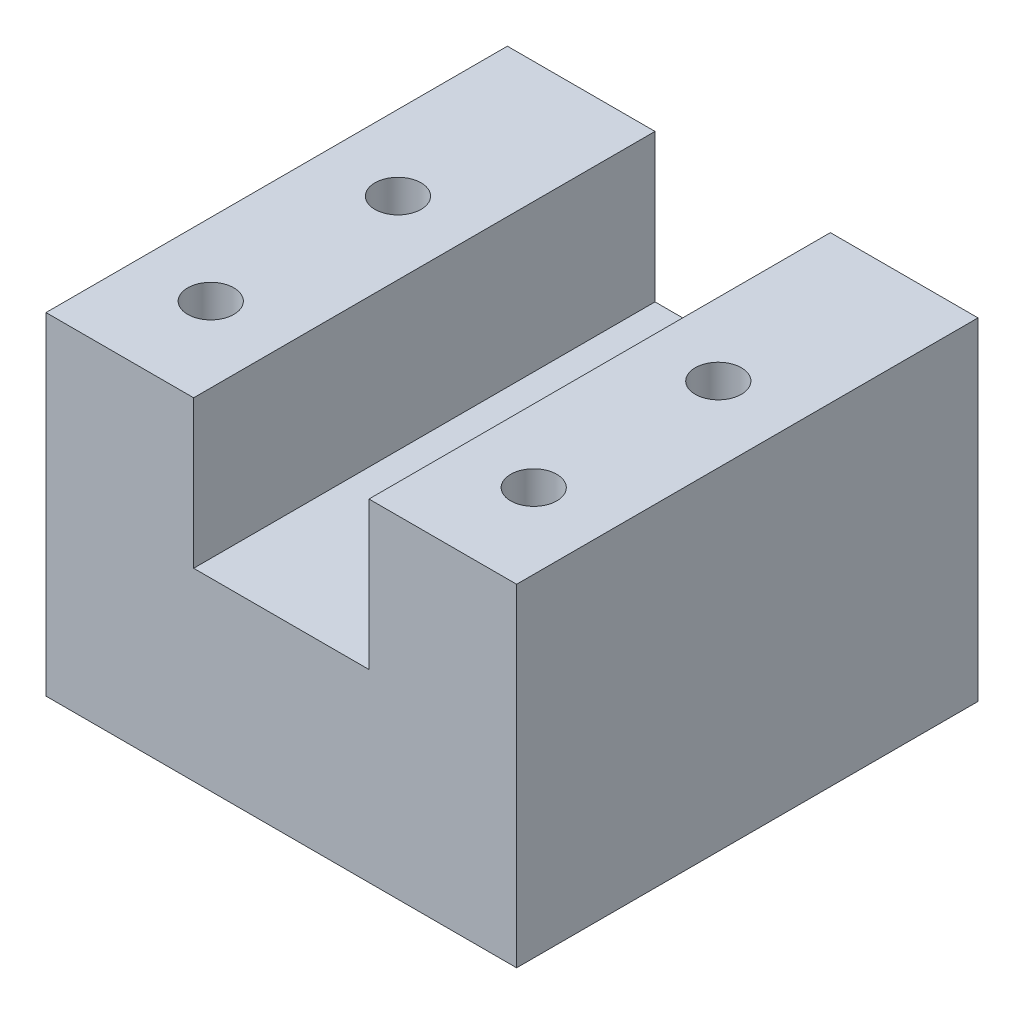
ISO-10303-21;
HEADER;
FILE_DESCRIPTION(('STEP AP214'),'2;1');
FILE_NAME('part.step','',(''),(''),'','','');
FILE_SCHEMA(('AUTOMOTIVE_DESIGN { 1 0 10303 214 1 1 1 1 }'));
ENDSEC;
DATA;
#1=APPLICATION_CONTEXT('core data for automotive mechanical design processes');
#2=APPLICATION_PROTOCOL_DEFINITION('international standard','automotive_design',2000,#1);
#3=PRODUCT_CONTEXT('',#1,'mechanical');
#4=PRODUCT('Part','Part','',(#3));
#5=PRODUCT_RELATED_PRODUCT_CATEGORY('part','',(#4));
#6=PRODUCT_DEFINITION_FORMATION('','',#4);
#7=PRODUCT_DEFINITION_CONTEXT('part definition',#1,'design');
#8=PRODUCT_DEFINITION('design','',#6,#7);
#9=PRODUCT_DEFINITION_SHAPE('','',#8);
#10=(LENGTH_UNIT() NAMED_UNIT(*) SI_UNIT(.MILLI.,.METRE.));
#11=(NAMED_UNIT(*) PLANE_ANGLE_UNIT() SI_UNIT($,.RADIAN.));
#12=(NAMED_UNIT(*) SI_UNIT($,.STERADIAN.) SOLID_ANGLE_UNIT());
#13=UNCERTAINTY_MEASURE_WITH_UNIT(LENGTH_MEASURE(1.E-05),#10,'distance_accuracy_value','');
#14=(GEOMETRIC_REPRESENTATION_CONTEXT(3) GLOBAL_UNCERTAINTY_ASSIGNED_CONTEXT((#13)) GLOBAL_UNIT_ASSIGNED_CONTEXT((#10,
#11,#12)) REPRESENTATION_CONTEXT('',''));
#15=CARTESIAN_POINT('',(0.,0.,0.));
#16=DIRECTION('',(0.,0.,1.));
#17=DIRECTION('',(1.,0.,0.));
#18=AXIS2_PLACEMENT_3D('',#15,#16,#17);
#19=CARTESIAN_POINT('',(8.,10.,25.));
#20=DIRECTION('',(0.,-1.,0.));
#21=DIRECTION('',(0.,0.,-1.));
#22=AXIS2_PLACEMENT_3D('',#19,#20,#21);
#23=PLANE('',#22);
#24=CARTESIAN_POINT('',(12.6780687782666,10.,6.5));
#25=DIRECTION('',(0.,1.,0.));
#26=DIRECTION('',(0.,0.,1.));
#27=AXIS2_PLACEMENT_3D('',#24,#25,#26);
#28=CIRCLE('',#27,2.);
#29=CARTESIAN_POINT('',(12.6780687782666,10.,8.5));
#30=VERTEX_POINT('',#29);
#31=EDGE_CURVE('E213',#30,#30,#28,.T.);
#32=ORIENTED_EDGE('',*,*,#31,.F.);
#33=EDGE_LOOP('',(#32));
#34=FACE_BOUND('',#33,.T.);
#35=DIRECTION('',(-1.,0.,0.));
#36=VECTOR('',#35,1.);
#37=CARTESIAN_POINT('',(8.,10.,0.));
#38=LINE('',#37,#36);
#39=CARTESIAN_POINT('',(17.5,10.,0.));
#40=VERTEX_POINT('',#39);
#41=CARTESIAN_POINT('',(8.,10.,0.));
#42=VERTEX_POINT('',#41);
#43=EDGE_CURVE('E129',#40,#42,#38,.T.);
#44=ORIENTED_EDGE('',*,*,#43,.T.);
#45=DIRECTION('',(0.,0.,-1.));
#46=VECTOR('',#45,1.);
#47=CARTESIAN_POINT('',(8.,10.,25.));
#48=LINE('',#47,#46);
#49=CARTESIAN_POINT('',(8.,10.,25.));
#50=VERTEX_POINT('',#49);
#51=EDGE_CURVE('E11',#50,#42,#48,.T.);
#52=ORIENTED_EDGE('',*,*,#51,.F.);
#53=DIRECTION('',(-1.,0.,0.));
#54=VECTOR('',#53,1.);
#55=CARTESIAN_POINT('',(8.,10.,25.));
#56=LINE('',#55,#54);
#57=CARTESIAN_POINT('',(17.5,10.,25.));
#58=VERTEX_POINT('',#57);
#59=EDGE_CURVE('E144',#58,#50,#56,.T.);
#60=ORIENTED_EDGE('',*,*,#59,.F.);
#61=DIRECTION('',(0.,0.,-1.));
#62=VECTOR('',#61,1.);
#63=CARTESIAN_POINT('',(17.5,10.,25.));
#64=LINE('',#63,#62);
#65=EDGE_CURVE('E125',#58,#40,#64,.T.);
#66=ORIENTED_EDGE('',*,*,#65,.T.);
#67=EDGE_LOOP('',(#44,#52,#60,#66));
#68=FACE_BOUND('',#67,.T.);
#69=ADVANCED_FACE('F32',(#34,#68),#23,.F.);
#70=CARTESIAN_POINT('',(8.,10.,25.));
#71=DIRECTION('',(-1.,0.,0.));
#72=DIRECTION('',(0.,0.,1.));
#73=AXIS2_PLACEMENT_3D('',#70,#71,#72);
#74=PLANE('',#73);
#75=DIRECTION('',(0.,1.,0.));
#76=VECTOR('',#75,1.);
#77=CARTESIAN_POINT('',(8.,10.,0.));
#78=LINE('',#77,#76);
#79=CARTESIAN_POINT('',(8.,18.,0.));
#80=VERTEX_POINT('',#79);
#81=EDGE_CURVE('E132',#42,#80,#78,.T.);
#82=ORIENTED_EDGE('',*,*,#81,.T.);
#83=DIRECTION('',(0.,0.,-1.));
#84=VECTOR('',#83,1.);
#85=CARTESIAN_POINT('',(8.,18.,25.));
#86=LINE('',#85,#84);
#87=CARTESIAN_POINT('',(8.,18.,25.));
#88=VERTEX_POINT('',#87);
#89=EDGE_CURVE('E41',#88,#80,#86,.T.);
#90=ORIENTED_EDGE('',*,*,#89,.F.);
#91=DIRECTION('',(0.,1.,0.));
#92=VECTOR('',#91,1.);
#93=CARTESIAN_POINT('',(8.,10.,25.));
#94=LINE('',#93,#92);
#95=EDGE_CURVE('E92',#50,#88,#94,.T.);
#96=ORIENTED_EDGE('',*,*,#95,.F.);
#97=ORIENTED_EDGE('',*,*,#51,.T.);
#98=EDGE_LOOP('',(#82,#90,#96,#97));
#99=FACE_BOUND('',#98,.T.);
#100=ADVANCED_FACE('F233',(#99),#74,.F.);
#101=CARTESIAN_POINT('',(0.,18.,25.));
#102=DIRECTION('',(0.,-1.,0.));
#103=DIRECTION('',(0.,0.,-1.));
#104=AXIS2_PLACEMENT_3D('',#101,#102,#103);
#105=PLANE('',#104);
#106=CARTESIAN_POINT('',(4.0719312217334,18.,10.));
#107=DIRECTION('',(0.,1.,0.));
#108=DIRECTION('',(0.,0.,-1.));
#109=AXIS2_PLACEMENT_3D('',#106,#107,#108);
#110=CIRCLE('',#109,1.25);
#111=CARTESIAN_POINT('',(4.0719312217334,18.,8.75));
#112=VERTEX_POINT('',#111);
#113=EDGE_CURVE('E196',#112,#112,#110,.T.);
#114=ORIENTED_EDGE('',*,*,#113,.F.);
#115=EDGE_LOOP('',(#114));
#116=FACE_BOUND('',#115,.T.);
#117=CARTESIAN_POINT('',(3.92806877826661,18.,20.));
#118=DIRECTION('',(0.,1.,0.));
#119=DIRECTION('',(0.,0.,1.));
#120=AXIS2_PLACEMENT_3D('',#117,#118,#119);
#121=CIRCLE('',#120,1.25);
#122=CARTESIAN_POINT('',(3.92806877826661,18.,21.25));
#123=VERTEX_POINT('',#122);
#124=EDGE_CURVE('E178',#123,#123,#121,.T.);
#125=ORIENTED_EDGE('',*,*,#124,.F.);
#126=EDGE_LOOP('',(#125));
#127=FACE_BOUND('',#126,.T.);
#128=DIRECTION('',(-1.,0.,0.));
#129=VECTOR('',#128,1.);
#130=CARTESIAN_POINT('',(0.,18.,0.));
#131=LINE('',#130,#129);
#132=CARTESIAN_POINT('',(0.,18.,0.));
#133=VERTEX_POINT('',#132);
#134=EDGE_CURVE('E135',#80,#133,#131,.T.);
#135=ORIENTED_EDGE('',*,*,#134,.T.);
#136=DIRECTION('',(0.,0.,-1.));
#137=VECTOR('',#136,1.);
#138=CARTESIAN_POINT('',(0.,18.,25.));
#139=LINE('',#138,#137);
#140=CARTESIAN_POINT('',(0.,18.,25.));
#141=VERTEX_POINT('',#140);
#142=EDGE_CURVE('E151',#141,#133,#139,.T.);
#143=ORIENTED_EDGE('',*,*,#142,.F.);
#144=DIRECTION('',(-1.,0.,0.));
#145=VECTOR('',#144,1.);
#146=CARTESIAN_POINT('',(0.,18.,25.));
#147=LINE('',#146,#145);
#148=EDGE_CURVE('E160',#88,#141,#147,.T.);
#149=ORIENTED_EDGE('',*,*,#148,.F.);
#150=ORIENTED_EDGE('',*,*,#89,.T.);
#151=EDGE_LOOP('',(#135,#143,#149,#150));
#152=FACE_BOUND('',#151,.T.);
#153=ADVANCED_FACE('F158',(#116,#127,#152),#105,.F.);
#154=CARTESIAN_POINT('',(0.,0.,25.));
#155=DIRECTION('',(1.,0.,0.));
#156=DIRECTION('',(0.,0.,-1.));
#157=AXIS2_PLACEMENT_3D('',#154,#155,#156);
#158=PLANE('',#157);
#159=DIRECTION('',(0.,-1.,0.));
#160=VECTOR('',#159,1.);
#161=CARTESIAN_POINT('',(0.,0.,0.));
#162=LINE('',#161,#160);
#163=CARTESIAN_POINT('',(0.,0.,0.));
#164=VERTEX_POINT('',#163);
#165=EDGE_CURVE('E137',#133,#164,#162,.T.);
#166=ORIENTED_EDGE('',*,*,#165,.T.);
#167=DIRECTION('',(0.,0.,-1.));
#168=VECTOR('',#167,1.);
#169=CARTESIAN_POINT('',(0.,0.,25.));
#170=LINE('',#169,#168);
#171=CARTESIAN_POINT('',(0.,0.,25.));
#172=VERTEX_POINT('',#171);
#173=EDGE_CURVE('E148',#172,#164,#170,.T.);
#174=ORIENTED_EDGE('',*,*,#173,.F.);
#175=DIRECTION('',(0.,-1.,0.));
#176=VECTOR('',#175,1.);
#177=CARTESIAN_POINT('',(0.,0.,25.));
#178=LINE('',#177,#176);
#179=EDGE_CURVE('E172',#141,#172,#178,.T.);
#180=ORIENTED_EDGE('',*,*,#179,.F.);
#181=ORIENTED_EDGE('',*,*,#142,.T.);
#182=EDGE_LOOP('',(#166,#174,#180,#181));
#183=FACE_BOUND('',#182,.T.);
#184=ADVANCED_FACE('F168',(#183),#158,.F.);
#185=CARTESIAN_POINT('',(0.,0.,25.));
#186=DIRECTION('',(0.,1.,0.));
#187=DIRECTION('',(0.,0.,1.));
#188=AXIS2_PLACEMENT_3D('',#185,#186,#187);
#189=PLANE('',#188);
#190=CARTESIAN_POINT('',(12.6780687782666,0.,6.5));
#191=DIRECTION('',(0.,1.,0.));
#192=DIRECTION('',(0.,0.,1.));
#193=AXIS2_PLACEMENT_3D('',#190,#191,#192);
#194=CIRCLE('',#193,2.);
#195=CARTESIAN_POINT('',(12.6780687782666,0.,8.5));
#196=VERTEX_POINT('',#195);
#197=EDGE_CURVE('E35',#196,#196,#194,.T.);
#198=ORIENTED_EDGE('',*,*,#197,.T.);
#199=EDGE_LOOP('',(#198));
#200=FACE_BOUND('',#199,.T.);
#201=CARTESIAN_POINT('',(21.4280687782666,0.,15.));
#202=DIRECTION('',(0.,-1.,0.));
#203=DIRECTION('',(0.,0.,-1.));
#204=AXIS2_PLACEMENT_3D('',#201,#202,#203);
#205=CIRCLE('',#204,1.66109742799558);
#206=CARTESIAN_POINT('',(21.4280687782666,0.,13.3389025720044));
#207=VERTEX_POINT('',#206);
#208=EDGE_CURVE('E208',#207,#207,#205,.T.);
#209=ORIENTED_EDGE('',*,*,#208,.F.);
#210=EDGE_LOOP('',(#209));
#211=FACE_BOUND('',#210,.T.);
#212=CARTESIAN_POINT('',(3.92806877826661,0.,15.));
#213=DIRECTION('',(0.,-1.,0.));
#214=DIRECTION('',(0.,0.,-1.));
#215=AXIS2_PLACEMENT_3D('',#212,#213,#214);
#216=CIRCLE('',#215,1.65);
#217=CARTESIAN_POINT('',(3.92806877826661,0.,13.35));
#218=VERTEX_POINT('',#217);
#219=EDGE_CURVE('E202',#218,#218,#216,.T.);
#220=ORIENTED_EDGE('',*,*,#219,.F.);
#221=EDGE_LOOP('',(#220));
#222=FACE_BOUND('',#221,.T.);
#223=DIRECTION('',(1.,0.,0.));
#224=VECTOR('',#223,1.);
#225=CARTESIAN_POINT('',(0.,0.,0.));
#226=LINE('',#225,#224);
#227=CARTESIAN_POINT('',(25.5,0.,0.));
#228=VERTEX_POINT('',#227);
#229=EDGE_CURVE('E139',#164,#228,#226,.T.);
#230=ORIENTED_EDGE('',*,*,#229,.T.);
#231=DIRECTION('',(0.,0.,-1.));
#232=VECTOR('',#231,1.);
#233=CARTESIAN_POINT('',(25.5,0.,25.));
#234=LINE('',#233,#232);
#235=CARTESIAN_POINT('',(25.5,0.,25.));
#236=VERTEX_POINT('',#235);
#237=EDGE_CURVE('E120',#236,#228,#234,.T.);
#238=ORIENTED_EDGE('',*,*,#237,.F.);
#239=DIRECTION('',(1.,0.,0.));
#240=VECTOR('',#239,1.);
#241=CARTESIAN_POINT('',(0.,0.,25.));
#242=LINE('',#241,#240);
#243=EDGE_CURVE('E111',#172,#236,#242,.T.);
#244=ORIENTED_EDGE('',*,*,#243,.F.);
#245=ORIENTED_EDGE('',*,*,#173,.T.);
#246=EDGE_LOOP('',(#230,#238,#244,#245));
#247=FACE_BOUND('',#246,.T.);
#248=ADVANCED_FACE('F171',(#200,#211,#222,#247),#189,.F.);
#249=CARTESIAN_POINT('',(25.5,0.,25.));
#250=DIRECTION('',(-1.,0.,0.));
#251=DIRECTION('',(0.,0.,1.));
#252=AXIS2_PLACEMENT_3D('',#249,#250,#251);
#253=PLANE('',#252);
#254=DIRECTION('',(0.,1.,0.));
#255=VECTOR('',#254,1.);
#256=CARTESIAN_POINT('',(25.5,0.,0.));
#257=LINE('',#256,#255);
#258=CARTESIAN_POINT('',(25.5,18.,0.));
#259=VERTEX_POINT('',#258);
#260=EDGE_CURVE('E119',#228,#259,#257,.T.);
#261=ORIENTED_EDGE('',*,*,#260,.T.);
#262=DIRECTION('',(0.,0.,-1.));
#263=VECTOR('',#262,1.);
#264=CARTESIAN_POINT('',(25.5,18.,25.));
#265=LINE('',#264,#263);
#266=CARTESIAN_POINT('',(25.5,18.,25.));
#267=VERTEX_POINT('',#266);
#268=EDGE_CURVE('E116',#267,#259,#265,.T.);
#269=ORIENTED_EDGE('',*,*,#268,.F.);
#270=DIRECTION('',(0.,1.,0.));
#271=VECTOR('',#270,1.);
#272=CARTESIAN_POINT('',(25.5,0.,25.));
#273=LINE('',#272,#271);
#274=EDGE_CURVE('E105',#236,#267,#273,.T.);
#275=ORIENTED_EDGE('',*,*,#274,.F.);
#276=ORIENTED_EDGE('',*,*,#237,.T.);
#277=EDGE_LOOP('',(#261,#269,#275,#276));
#278=FACE_BOUND('',#277,.T.);
#279=ADVANCED_FACE('F117',(#278),#253,.F.);
#280=CARTESIAN_POINT('',(17.5,18.,25.));
#281=DIRECTION('',(0.,-1.,0.));
#282=DIRECTION('',(0.,0.,-1.));
#283=AXIS2_PLACEMENT_3D('',#280,#281,#282);
#284=PLANE('',#283);
#285=CARTESIAN_POINT('',(21.4280687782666,18.,20.));
#286=DIRECTION('',(0.,1.,0.));
#287=DIRECTION('',(0.,0.,1.));
#288=AXIS2_PLACEMENT_3D('',#285,#286,#287);
#289=CIRCLE('',#288,1.25);
#290=CARTESIAN_POINT('',(21.4280687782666,18.,21.25));
#291=VERTEX_POINT('',#290);
#292=EDGE_CURVE('E190',#291,#291,#289,.T.);
#293=ORIENTED_EDGE('',*,*,#292,.F.);
#294=EDGE_LOOP('',(#293));
#295=FACE_BOUND('',#294,.T.);
#296=CARTESIAN_POINT('',(21.4280687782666,18.,10.));
#297=DIRECTION('',(0.,1.,0.));
#298=DIRECTION('',(0.,0.,1.));
#299=AXIS2_PLACEMENT_3D('',#296,#297,#298);
#300=CIRCLE('',#299,1.25);
#301=CARTESIAN_POINT('',(21.4280687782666,18.,11.25));
#302=VERTEX_POINT('',#301);
#303=EDGE_CURVE('E184',#302,#302,#300,.T.);
#304=ORIENTED_EDGE('',*,*,#303,.F.);
#305=EDGE_LOOP('',(#304));
#306=FACE_BOUND('',#305,.T.);
#307=DIRECTION('',(-1.,0.,0.));
#308=VECTOR('',#307,1.);
#309=CARTESIAN_POINT('',(17.5,18.,0.));
#310=LINE('',#309,#308);
#311=CARTESIAN_POINT('',(17.5,18.,0.));
#312=VERTEX_POINT('',#311);
#313=EDGE_CURVE('E78',#259,#312,#310,.T.);
#314=ORIENTED_EDGE('',*,*,#313,.T.);
#315=DIRECTION('',(0.,0.,-1.));
#316=VECTOR('',#315,1.);
#317=CARTESIAN_POINT('',(17.5,18.,25.));
#318=LINE('',#317,#316);
#319=CARTESIAN_POINT('',(17.5,18.,25.));
#320=VERTEX_POINT('',#319);
#321=EDGE_CURVE('E121',#320,#312,#318,.T.);
#322=ORIENTED_EDGE('',*,*,#321,.F.);
#323=DIRECTION('',(-1.,0.,0.));
#324=VECTOR('',#323,1.);
#325=CARTESIAN_POINT('',(17.5,18.,25.));
#326=LINE('',#325,#324);
#327=EDGE_CURVE('E109',#267,#320,#326,.T.);
#328=ORIENTED_EDGE('',*,*,#327,.F.);
#329=ORIENTED_EDGE('',*,*,#268,.T.);
#330=EDGE_LOOP('',(#314,#322,#328,#329));
#331=FACE_BOUND('',#330,.T.);
#332=ADVANCED_FACE('F123',(#295,#306,#331),#284,.F.);
#333=CARTESIAN_POINT('',(17.5,10.,25.));
#334=DIRECTION('',(1.,0.,0.));
#335=DIRECTION('',(0.,0.,-1.));
#336=AXIS2_PLACEMENT_3D('',#333,#334,#335);
#337=PLANE('',#336);
#338=DIRECTION('',(0.,-1.,0.));
#339=VECTOR('',#338,1.);
#340=CARTESIAN_POINT('',(17.5,10.,0.));
#341=LINE('',#340,#339);
#342=EDGE_CURVE('E84',#312,#40,#341,.T.);
#343=ORIENTED_EDGE('',*,*,#342,.T.);
#344=ORIENTED_EDGE('',*,*,#65,.F.);
#345=DIRECTION('',(0.,-1.,0.));
#346=VECTOR('',#345,1.);
#347=CARTESIAN_POINT('',(17.5,10.,25.));
#348=LINE('',#347,#346);
#349=EDGE_CURVE('E49',#320,#58,#348,.T.);
#350=ORIENTED_EDGE('',*,*,#349,.F.);
#351=ORIENTED_EDGE('',*,*,#321,.T.);
#352=EDGE_LOOP('',(#343,#344,#350,#351));
#353=FACE_BOUND('',#352,.T.);
#354=ADVANCED_FACE('F241',(#353),#337,.F.);
#355=CARTESIAN_POINT('',(17.5,10.,25.));
#356=DIRECTION('',(0.,0.,1.));
#357=DIRECTION('',(1.,0.,0.));
#358=AXIS2_PLACEMENT_3D('',#355,#356,#357);
#359=PLANE('',#358);
#360=ORIENTED_EDGE('',*,*,#59,.T.);
#361=ORIENTED_EDGE('',*,*,#95,.T.);
#362=ORIENTED_EDGE('',*,*,#148,.T.);
#363=ORIENTED_EDGE('',*,*,#179,.T.);
#364=ORIENTED_EDGE('',*,*,#243,.T.);
#365=ORIENTED_EDGE('',*,*,#274,.T.);
#366=ORIENTED_EDGE('',*,*,#327,.T.);
#367=ORIENTED_EDGE('',*,*,#349,.T.);
#368=EDGE_LOOP('',(#360,#361,#362,#363,#364,#365,#366,#367));
#369=FACE_BOUND('',#368,.T.);
#370=ADVANCED_FACE('F107',(#369),#359,.T.);
#371=CARTESIAN_POINT('',(17.5,10.,0.));
#372=DIRECTION('',(0.,0.,1.));
#373=DIRECTION('',(1.,0.,0.));
#374=AXIS2_PLACEMENT_3D('',#371,#372,#373);
#375=PLANE('',#374);
#376=ORIENTED_EDGE('',*,*,#43,.F.);
#377=ORIENTED_EDGE('',*,*,#342,.F.);
#378=ORIENTED_EDGE('',*,*,#313,.F.);
#379=ORIENTED_EDGE('',*,*,#260,.F.);
#380=ORIENTED_EDGE('',*,*,#229,.F.);
#381=ORIENTED_EDGE('',*,*,#165,.F.);
#382=ORIENTED_EDGE('',*,*,#134,.F.);
#383=ORIENTED_EDGE('',*,*,#81,.F.);
#384=EDGE_LOOP('',(#376,#377,#378,#379,#380,#381,#382,#383));
#385=FACE_BOUND('',#384,.T.);
#386=ADVANCED_FACE('F164',(#385),#375,.F.);
#387=CARTESIAN_POINT('',(3.92806877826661,6.,20.));
#388=DIRECTION('',(0.,1.,0.));
#389=DIRECTION('',(0.,0.,1.));
#390=AXIS2_PLACEMENT_3D('',#387,#388,#389);
#391=CYLINDRICAL_SURFACE('',#390,1.25);
#392=CARTESIAN_POINT('',(3.92806877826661,6.,20.));
#393=DIRECTION('',(0.,1.,0.));
#394=DIRECTION('',(0.,0.,1.));
#395=AXIS2_PLACEMENT_3D('',#392,#393,#394);
#396=CIRCLE('',#395,1.25);
#397=CARTESIAN_POINT('',(3.92806877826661,6.,21.25));
#398=VERTEX_POINT('',#397);
#399=EDGE_CURVE('E133',#398,#398,#396,.T.);
#400=ORIENTED_EDGE('',*,*,#399,.F.);
#401=EDGE_LOOP('',(#400));
#402=FACE_BOUND('',#401,.T.);
#403=ORIENTED_EDGE('',*,*,#124,.T.);
#404=EDGE_LOOP('',(#403));
#405=FACE_BOUND('',#404,.T.);
#406=ADVANCED_FACE('F267',(#402,#405),#391,.F.);
#407=CARTESIAN_POINT('',(3.92806877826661,6.,20.));
#408=DIRECTION('',(0.,1.,0.));
#409=DIRECTION('',(0.,0.,1.));
#410=AXIS2_PLACEMENT_3D('',#407,#408,#409);
#411=PLANE('',#410);
#412=ORIENTED_EDGE('',*,*,#399,.T.);
#413=EDGE_LOOP('',(#412));
#414=FACE_BOUND('',#413,.T.);
#415=ADVANCED_FACE('F269',(#414),#411,.T.);
#416=CARTESIAN_POINT('',(21.4280687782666,6.,10.));
#417=DIRECTION('',(0.,1.,0.));
#418=DIRECTION('',(0.,0.,1.));
#419=AXIS2_PLACEMENT_3D('',#416,#417,#418);
#420=CYLINDRICAL_SURFACE('',#419,1.25);
#421=CARTESIAN_POINT('',(21.4280687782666,6.,10.));
#422=DIRECTION('',(0.,1.,0.));
#423=DIRECTION('',(0.,0.,1.));
#424=AXIS2_PLACEMENT_3D('',#421,#422,#423);
#425=CIRCLE('',#424,1.25);
#426=CARTESIAN_POINT('',(21.4280687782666,6.,11.25));
#427=VERTEX_POINT('',#426);
#428=EDGE_CURVE('E181',#427,#427,#425,.T.);
#429=ORIENTED_EDGE('',*,*,#428,.F.);
#430=EDGE_LOOP('',(#429));
#431=FACE_BOUND('',#430,.T.);
#432=ORIENTED_EDGE('',*,*,#303,.T.);
#433=EDGE_LOOP('',(#432));
#434=FACE_BOUND('',#433,.T.);
#435=ADVANCED_FACE('F276',(#431,#434),#420,.F.);
#436=CARTESIAN_POINT('',(21.4280687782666,6.,10.));
#437=DIRECTION('',(0.,1.,0.));
#438=DIRECTION('',(0.,0.,1.));
#439=AXIS2_PLACEMENT_3D('',#436,#437,#438);
#440=PLANE('',#439);
#441=ORIENTED_EDGE('',*,*,#428,.T.);
#442=EDGE_LOOP('',(#441));
#443=FACE_BOUND('',#442,.T.);
#444=ADVANCED_FACE('F283',(#443),#440,.T.);
#445=CARTESIAN_POINT('',(21.4280687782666,6.,20.));
#446=DIRECTION('',(0.,1.,0.));
#447=DIRECTION('',(0.,0.,1.));
#448=AXIS2_PLACEMENT_3D('',#445,#446,#447);
#449=CYLINDRICAL_SURFACE('',#448,1.25);
#450=CARTESIAN_POINT('',(21.4280687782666,6.,20.));
#451=DIRECTION('',(0.,1.,0.));
#452=DIRECTION('',(0.,0.,1.));
#453=AXIS2_PLACEMENT_3D('',#450,#451,#452);
#454=CIRCLE('',#453,1.25);
#455=CARTESIAN_POINT('',(21.4280687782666,6.,21.25));
#456=VERTEX_POINT('',#455);
#457=EDGE_CURVE('E187',#456,#456,#454,.T.);
#458=ORIENTED_EDGE('',*,*,#457,.F.);
#459=EDGE_LOOP('',(#458));
#460=FACE_BOUND('',#459,.T.);
#461=ORIENTED_EDGE('',*,*,#292,.T.);
#462=EDGE_LOOP('',(#461));
#463=FACE_BOUND('',#462,.T.);
#464=ADVANCED_FACE('F287',(#460,#463),#449,.F.);
#465=CARTESIAN_POINT('',(21.4280687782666,6.,20.));
#466=DIRECTION('',(0.,1.,0.));
#467=DIRECTION('',(0.,0.,1.));
#468=AXIS2_PLACEMENT_3D('',#465,#466,#467);
#469=PLANE('',#468);
#470=ORIENTED_EDGE('',*,*,#457,.T.);
#471=EDGE_LOOP('',(#470));
#472=FACE_BOUND('',#471,.T.);
#473=ADVANCED_FACE('F291',(#472),#469,.T.);
#474=CARTESIAN_POINT('',(4.0719312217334,6.,10.));
#475=DIRECTION('',(0.,1.,0.));
#476=DIRECTION('',(0.,0.,1.));
#477=AXIS2_PLACEMENT_3D('',#474,#475,#476);
#478=CYLINDRICAL_SURFACE('',#477,1.25);
#479=CARTESIAN_POINT('',(4.0719312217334,6.,10.));
#480=DIRECTION('',(0.,1.,0.));
#481=DIRECTION('',(0.,0.,-1.));
#482=AXIS2_PLACEMENT_3D('',#479,#480,#481);
#483=CIRCLE('',#482,1.25);
#484=CARTESIAN_POINT('',(4.0719312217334,6.,8.75));
#485=VERTEX_POINT('',#484);
#486=EDGE_CURVE('E193',#485,#485,#483,.T.);
#487=ORIENTED_EDGE('',*,*,#486,.F.);
#488=EDGE_LOOP('',(#487));
#489=FACE_BOUND('',#488,.T.);
#490=ORIENTED_EDGE('',*,*,#113,.T.);
#491=EDGE_LOOP('',(#490));
#492=FACE_BOUND('',#491,.T.);
#493=ADVANCED_FACE('F295',(#489,#492),#478,.F.);
#494=CARTESIAN_POINT('',(4.0719312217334,6.,10.));
#495=DIRECTION('',(0.,-1.,0.));
#496=DIRECTION('',(0.,0.,-1.));
#497=AXIS2_PLACEMENT_3D('',#494,#495,#496);
#498=PLANE('',#497);
#499=ORIENTED_EDGE('',*,*,#486,.T.);
#500=EDGE_LOOP('',(#499));
#501=FACE_BOUND('',#500,.T.);
#502=ADVANCED_FACE('F299',(#501),#498,.F.);
#503=CARTESIAN_POINT('',(3.92806877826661,12.,15.));
#504=DIRECTION('',(0.,-1.,0.));
#505=DIRECTION('',(0.,0.,-1.));
#506=AXIS2_PLACEMENT_3D('',#503,#504,#505);
#507=CYLINDRICAL_SURFACE('',#506,1.65);
#508=CARTESIAN_POINT('',(3.92806877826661,12.,15.));
#509=DIRECTION('',(0.,-1.,0.));
#510=DIRECTION('',(0.,0.,-1.));
#511=AXIS2_PLACEMENT_3D('',#508,#509,#510);
#512=CIRCLE('',#511,1.65);
#513=CARTESIAN_POINT('',(3.92806877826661,12.,13.35));
#514=VERTEX_POINT('',#513);
#515=EDGE_CURVE('E199',#514,#514,#512,.T.);
#516=ORIENTED_EDGE('',*,*,#515,.F.);
#517=EDGE_LOOP('',(#516));
#518=FACE_BOUND('',#517,.T.);
#519=ORIENTED_EDGE('',*,*,#219,.T.);
#520=EDGE_LOOP('',(#519));
#521=FACE_BOUND('',#520,.T.);
#522=ADVANCED_FACE('F303',(#518,#521),#507,.F.);
#523=CARTESIAN_POINT('',(3.92806877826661,12.,15.));
#524=DIRECTION('',(0.,-1.,0.));
#525=DIRECTION('',(0.,0.,-1.));
#526=AXIS2_PLACEMENT_3D('',#523,#524,#525);
#527=PLANE('',#526);
#528=ORIENTED_EDGE('',*,*,#515,.T.);
#529=EDGE_LOOP('',(#528));
#530=FACE_BOUND('',#529,.T.);
#531=ADVANCED_FACE('F307',(#530),#527,.T.);
#532=CARTESIAN_POINT('',(21.4280687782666,12.,15.));
#533=DIRECTION('',(0.,-1.,0.));
#534=DIRECTION('',(0.,0.,-1.));
#535=AXIS2_PLACEMENT_3D('',#532,#533,#534);
#536=CYLINDRICAL_SURFACE('',#535,1.66109742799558);
#537=CARTESIAN_POINT('',(21.4280687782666,12.,15.));
#538=DIRECTION('',(0.,-1.,0.));
#539=DIRECTION('',(0.,0.,-1.));
#540=AXIS2_PLACEMENT_3D('',#537,#538,#539);
#541=CIRCLE('',#540,1.66109742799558);
#542=CARTESIAN_POINT('',(21.4280687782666,12.,13.3389025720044));
#543=VERTEX_POINT('',#542);
#544=EDGE_CURVE('E205',#543,#543,#541,.T.);
#545=ORIENTED_EDGE('',*,*,#544,.F.);
#546=EDGE_LOOP('',(#545));
#547=FACE_BOUND('',#546,.T.);
#548=ORIENTED_EDGE('',*,*,#208,.T.);
#549=EDGE_LOOP('',(#548));
#550=FACE_BOUND('',#549,.T.);
#551=ADVANCED_FACE('F229',(#547,#550),#536,.F.);
#552=CARTESIAN_POINT('',(21.4280687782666,12.,15.));
#553=DIRECTION('',(0.,-1.,0.));
#554=DIRECTION('',(0.,0.,-1.));
#555=AXIS2_PLACEMENT_3D('',#552,#553,#554);
#556=PLANE('',#555);
#557=ORIENTED_EDGE('',*,*,#544,.T.);
#558=EDGE_LOOP('',(#557));
#559=FACE_BOUND('',#558,.T.);
#560=ADVANCED_FACE('F224',(#559),#556,.T.);
#561=CARTESIAN_POINT('',(12.6780687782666,-2.,6.5));
#562=DIRECTION('',(0.,1.,0.));
#563=DIRECTION('',(0.,0.,1.));
#564=AXIS2_PLACEMENT_3D('',#561,#562,#563);
#565=CYLINDRICAL_SURFACE('',#564,2.);
#566=ORIENTED_EDGE('',*,*,#31,.T.);
#567=EDGE_LOOP('',(#566));
#568=FACE_BOUND('',#567,.T.);
#569=ORIENTED_EDGE('',*,*,#197,.F.);
#570=EDGE_LOOP('',(#569));
#571=FACE_BOUND('',#570,.T.);
#572=ADVANCED_FACE('F222',(#568,#571),#565,.F.);
#573=CLOSED_SHELL('',(#69,#100,#153,#184,#248,#279,#332,#354,#370,#386,#406,#415,#435,#444,#464,
#473,#493,#502,#522,#531,#551,#560,#572));
#574=MANIFOLD_SOLID_BREP('B2',#573);
#575=ADVANCED_BREP_SHAPE_REPRESENTATION('',(#18,#574),#14);
#576=SHAPE_DEFINITION_REPRESENTATION(#9,#575);
ENDSEC;
END-ISO-10303-21;
